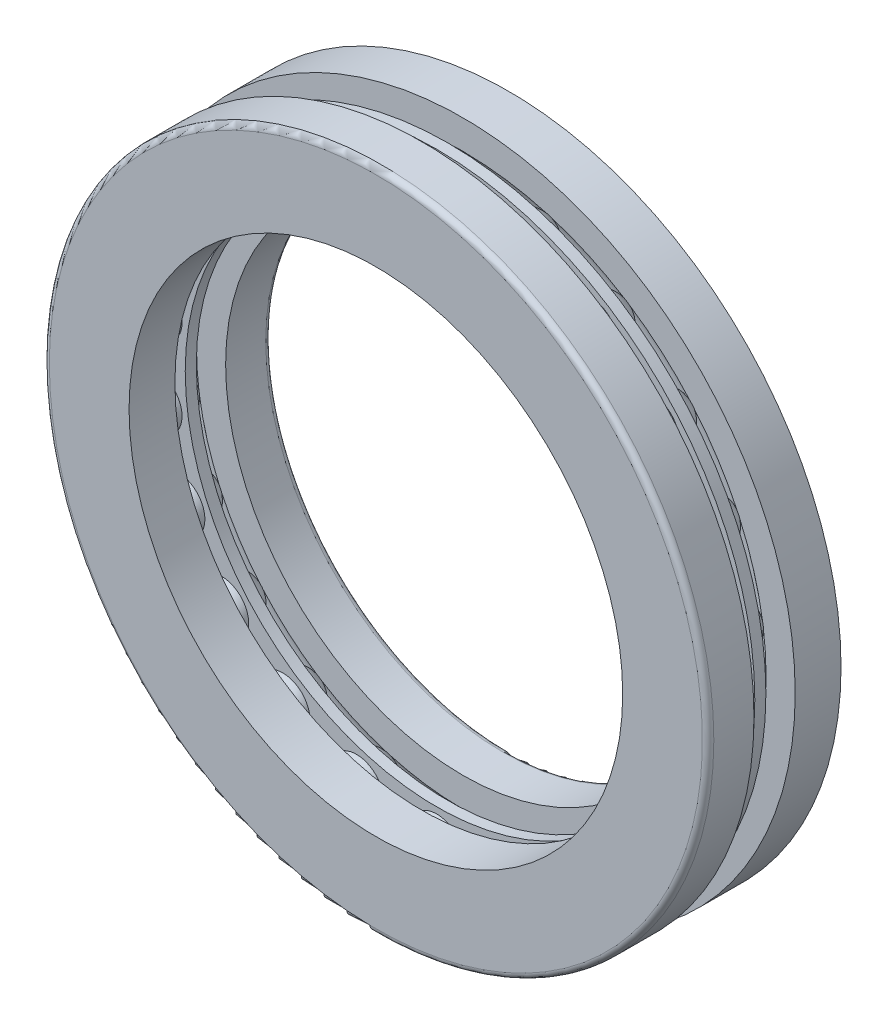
from build123d import *
from build123d.topology import SkipClean

# Parameters (mm, degrees)
FILLET1_R            = 0.6
CIRPATTERNBALL_COUNT = 22
CAGESKE_W            = 1.166666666
CAGESKE_H            = 7


with BuildPart() as part:
    # BaseSke → Ball (revolve)
    with BuildSketch(Plane(origin=(0, 0, 0), x_dir=(0, 0, -1), z_dir=(1, 0, 0))):
        with BuildLine():
            Line((0, 32.916666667), (0, 27.083333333))
            ThreePointArc((0, 27.083333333), (-2.916666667, 30), (0, 32.916666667))
        make_face()
    ball = revolve(axis=Axis((0, 32.916666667, 0), (0, -1, 0)))

    # InnerRaceSke → InnerRace (revolve)
    with BuildSketch(Plane(origin=(0, 0, 0), x_dir=(0, 0, -1), z_dir=(1, 0, 0)), mode=Mode.PRIVATE) as innerrace_sk:
        with BuildLine():
            Line((2.172413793, 28.068852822), (2.172413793, 25))
            Line((2.172413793, 25), (7, 25))
            Line((7, 25), (7, 35))
            Line((7, 35), (2.172413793, 35))
            Line((2.172413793, 35), (2.172413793, 31.931147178))
            ThreePointArc((2.172413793, 31.931147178), (2.906666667, 30), (2.172413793, 28.068852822))
        make_face()
    revolve(innerrace_sk.sketch.rotate(Axis((0, 0, 18.95903793), (0, 0, -1)), 90), axis=Axis((0, 0, 18.95903793), (0, 0, -1)))

    # OuterRaceSke → OuterRace (revolve)
    with BuildSketch(Plane(origin=(0, 0, 0), x_dir=(0, 0, -1), z_dir=(1, 0, 0)), mode=Mode.PRIVATE) as outerrace_sk:
        with BuildLine():
            Line((-2.172413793, 28.068852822), (-2.172413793, 26))
            Line((-2.172413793, 26), (-7, 26))
            Line((-7, 26), (-7, 35))
            Line((-7, 35), (-2.172413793, 35))
            Line((-2.172413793, 35), (-2.172413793, 31.931147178))
            ThreePointArc((-2.172413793, 31.931147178), (-2.906666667, 30), (-2.172413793, 28.068852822))
        make_face()
    revolve(outerrace_sk.sketch.rotate(Axis((0, 0, 27.164343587), (0, 0, -1)), 90), axis=Axis((0, 0, 27.164343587), (0, 0, -1)))

    # Fillet1
    fillet1_edges = [part.edges().sort_by_distance(p)[0] for p in [
        (-35, 0, 7),
        (-25, 0, -7),
    ]]
    fillet(fillet1_edges, radius=FILLET1_R)

    # CirPatternBall: Ball ×22 about axis
    cirpatternball_axis = Axis((0, 0, 0), (0, 0, 1))
    for i in range(1, CIRPATTERNBALL_COUNT):
        add(ball.rotate(cirpatternball_axis, i * 360 / CIRPATTERNBALL_COUNT))

    # CageSke → Cage (revolve)
    with SkipClean():  # the faces are left unmerged after this step: merging them gives an invalid solid
        with BuildSketch(Plane(origin=(0, 0, 0), x_dir=(0, 0, -1), z_dir=(1, 0, 0)), mode=Mode.PRIVATE) as cage_sk:
            with Locations((0, 30)):
                Rectangle(CAGESKE_W, CAGESKE_H)
        revolve(cage_sk.sketch.rotate(Axis((0, 0, 23.077030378), (0, 0, -1)), 90), axis=Axis((0, 0, 23.077030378), (0, 0, -1)))


solid = part.part
